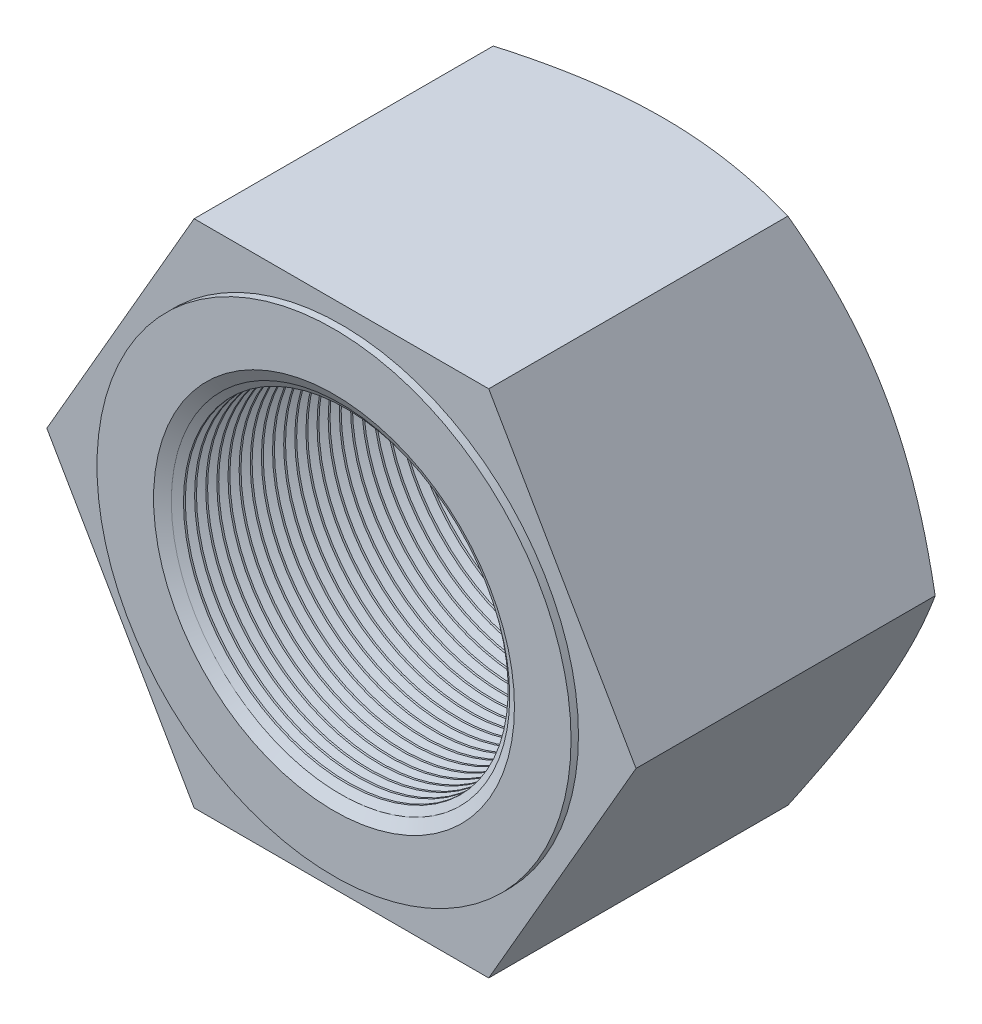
from build123d import *

# Parameters (mm, degrees)
SKETCH1_R         = 17.5
BASENUT_DEPTH     = 34.7
EXTRUDE1_START    = 0.8
SKETCH3_R         = 25.55
SKETCH3_R_2       = 17.5
EXTRUDE1_DEPTH    = 0.8
ENDCHAMFER3_SIZE  = 1.95
ENDCHAMFER3_SIZE2 = 1.125833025
LPATTERN10_COUNT  = 29
LPATTERN10_PITCH  = 1.2


with BuildPart() as part:
    # Sketch1 → BaseNut (new body)
    with BuildSketch(Plane.XY):
        Polygon((15.877132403, -27.5), (31.754264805, 0), (15.877132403, 27.5), (-15.877132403, 27.5), (-31.754264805, 0), (-15.877132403, -27.5), align=None)
        Circle(SKETCH1_R, mode=Mode.SUBTRACT)
    extrude(amount=-BASENUT_DEPTH)

    # Sketch2 → Chamfer1 (revolve, cut)
    with BuildSketch(Plane(origin=(-16.706149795, 0, -15.04811501), x_dir=(0, 0, 1), z_dir=(0, 1, 0))):
        Polygon((-19.65188499, 44.206149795), (-19.65188499, 48.460414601), (-17.195684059, 48.460414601), align=None)
    revolve(axis=Axis((0, 0, -38.770766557), (0, 0, 1)), mode=Mode.SUBTRACT)

    # Sketch6 → EndChamfer1 (revolve, cut)
    with BuildSketch(Plane(origin=(-9.197458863, 0, -10.252541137), x_dir=(0, 0, 1), z_dir=(0, 1, 0))):
        Polygon((-24.447458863, 26.697458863), (-24.447458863, 28.647458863), (-23.321625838, 26.697458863), align=None)
    revolve(axis=Axis((0, 0, 13.104863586), (0, 0, -1)), mode=Mode.SUBTRACT)

    # Sketch3 → Extrude1 (add)
    with BuildSketch(Plane(origin=(-18.48918612, 11.17895969, 0), x_dir=(1, 0, 0), z_dir=(0, 0, 1)).offset(EXTRUDE1_START)):
        with Locations((18.48918612, -11.17895969)):
            Circle(SKETCH3_R)
        with Locations((18.48918612, -11.17895969)):
            Circle(SKETCH3_R_2, mode=Mode.SUBTRACT)
    extrude(amount=-EXTRUDE1_DEPTH)

    # EndChamfer3
    endchamfer3_edges = [part.edges().sort_by_distance(p)[0] for p in [
        (-17.5, 0, 0.8),
    ]]
    endchamfer3_side = [part.faces().sort_by_distance(p)[0] for p in [
        (-24.82733687, 0, 0.8),
    ]]
    chamfer(endchamfer3_edges, length=ENDCHAMFER3_SIZE, length2=ENDCHAMFER3_SIZE2, reference=endchamfer3_side[0])

    # Sketch7 → Cut-Revolve10 (revolve, cut)
    with BuildSketch(Plane(origin=(0, 0, 0), x_dir=(1, 0, 0), z_dir=(0, 1, 0))):
        Polygon((16.5, 34.074166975), (17.5, 34.074166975), (18.366025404, 33.574166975), (17.5, 33.074166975), (16.5, 33.074166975), align=None)
    cut_revolve10 = revolve(axis=Axis((0, 0, -61.609777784), (0, 0, 1)), mode=Mode.SUBTRACT)

    # LPattern10: Cut-Revolve10 ×29
    with Locations(*[(0, 0, i * LPATTERN10_PITCH) for i in range(1, LPATTERN10_COUNT)]):
        add(cut_revolve10, mode=Mode.SUBTRACT)


solid = part.part
